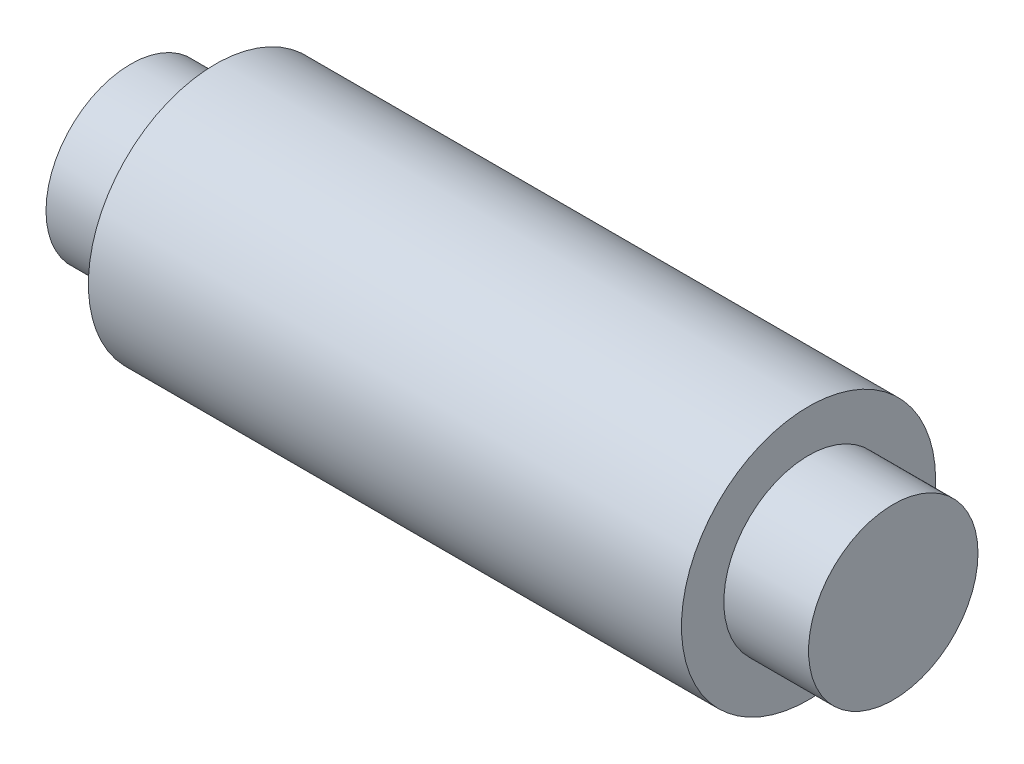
ISO-10303-21;
HEADER;
FILE_DESCRIPTION(('STEP AP214'),'2;1');
FILE_NAME('part.step','',(''),(''),'','','');
FILE_SCHEMA(('AUTOMOTIVE_DESIGN { 1 0 10303 214 1 1 1 1 }'));
ENDSEC;
DATA;
#1=APPLICATION_CONTEXT('core data for automotive mechanical design processes');
#2=APPLICATION_PROTOCOL_DEFINITION('international standard','automotive_design',2000,#1);
#3=PRODUCT_CONTEXT('',#1,'mechanical');
#4=PRODUCT('Part','Part','',(#3));
#5=PRODUCT_RELATED_PRODUCT_CATEGORY('part','',(#4));
#6=PRODUCT_DEFINITION_FORMATION('','',#4);
#7=PRODUCT_DEFINITION_CONTEXT('part definition',#1,'design');
#8=PRODUCT_DEFINITION('design','',#6,#7);
#9=PRODUCT_DEFINITION_SHAPE('','',#8);
#10=(LENGTH_UNIT() NAMED_UNIT(*) SI_UNIT(.MILLI.,.METRE.));
#11=(NAMED_UNIT(*) PLANE_ANGLE_UNIT() SI_UNIT($,.RADIAN.));
#12=(NAMED_UNIT(*) SI_UNIT($,.STERADIAN.) SOLID_ANGLE_UNIT());
#13=UNCERTAINTY_MEASURE_WITH_UNIT(LENGTH_MEASURE(1.E-05),#10,'distance_accuracy_value','');
#14=(GEOMETRIC_REPRESENTATION_CONTEXT(3) GLOBAL_UNCERTAINTY_ASSIGNED_CONTEXT((#13)) GLOBAL_UNIT_ASSIGNED_CONTEXT((#10,
#11,#12)) REPRESENTATION_CONTEXT('',''));
#15=CARTESIAN_POINT('',(0.,0.,0.));
#16=DIRECTION('',(0.,0.,1.));
#17=DIRECTION('',(1.,0.,0.));
#18=AXIS2_PLACEMENT_3D('',#15,#16,#17);
#19=CARTESIAN_POINT('',(35.,0.,0.));
#20=DIRECTION('',(-1.,0.,0.));
#21=DIRECTION('',(0.,0.,1.));
#22=AXIS2_PLACEMENT_3D('',#19,#20,#21);
#23=CYLINDRICAL_SURFACE('',#22,15.);
#24=CARTESIAN_POINT('',(35.,0.,0.));
#25=DIRECTION('',(1.,0.,0.));
#26=DIRECTION('',(0.,0.,-1.));
#27=AXIS2_PLACEMENT_3D('',#24,#25,#26);
#28=CIRCLE('',#27,15.);
#29=CARTESIAN_POINT('',(35.,0.,-15.));
#30=VERTEX_POINT('',#29);
#31=EDGE_CURVE('E37',#30,#30,#28,.T.);
#32=ORIENTED_EDGE('',*,*,#31,.F.);
#33=EDGE_LOOP('',(#32));
#34=FACE_BOUND('',#33,.T.);
#35=CARTESIAN_POINT('',(-35.,0.,0.));
#36=DIRECTION('',(1.,0.,0.));
#37=DIRECTION('',(0.,0.,-1.));
#38=AXIS2_PLACEMENT_3D('',#35,#36,#37);
#39=CIRCLE('',#38,15.);
#40=CARTESIAN_POINT('',(-35.,0.,-15.));
#41=VERTEX_POINT('',#40);
#42=EDGE_CURVE('E41',#41,#41,#39,.T.);
#43=ORIENTED_EDGE('',*,*,#42,.T.);
#44=EDGE_LOOP('',(#43));
#45=FACE_BOUND('',#44,.T.);
#46=ADVANCED_FACE('F31',(#34,#45),#23,.T.);
#47=CARTESIAN_POINT('',(35.,0.,0.));
#48=DIRECTION('',(1.,0.,0.));
#49=DIRECTION('',(0.,0.,-1.));
#50=AXIS2_PLACEMENT_3D('',#47,#48,#49);
#51=PLANE('',#50);
#52=CARTESIAN_POINT('',(35.,0.,0.));
#53=DIRECTION('',(1.,0.,0.));
#54=DIRECTION('',(0.,0.,-1.));
#55=AXIS2_PLACEMENT_3D('',#52,#53,#54);
#56=CIRCLE('',#55,10.);
#57=CARTESIAN_POINT('',(35.,0.,-10.));
#58=VERTEX_POINT('',#57);
#59=EDGE_CURVE('E48',#58,#58,#56,.T.);
#60=ORIENTED_EDGE('',*,*,#59,.F.);
#61=EDGE_LOOP('',(#60));
#62=FACE_BOUND('',#61,.T.);
#63=ORIENTED_EDGE('',*,*,#31,.T.);
#64=EDGE_LOOP('',(#63));
#65=FACE_BOUND('',#64,.T.);
#66=ADVANCED_FACE('F72',(#62,#65),#51,.T.);
#67=CARTESIAN_POINT('',(-35.,0.,0.));
#68=DIRECTION('',(1.,0.,0.));
#69=DIRECTION('',(0.,0.,-1.));
#70=AXIS2_PLACEMENT_3D('',#67,#68,#69);
#71=PLANE('',#70);
#72=CARTESIAN_POINT('',(-35.,0.,0.));
#73=DIRECTION('',(1.,0.,0.));
#74=DIRECTION('',(0.,0.,-1.));
#75=AXIS2_PLACEMENT_3D('',#72,#73,#74);
#76=CIRCLE('',#75,10.);
#77=CARTESIAN_POINT('',(-35.,0.,-10.));
#78=VERTEX_POINT('',#77);
#79=EDGE_CURVE('E10',#78,#78,#76,.F.);
#80=ORIENTED_EDGE('',*,*,#79,.F.);
#81=EDGE_LOOP('',(#80));
#82=FACE_BOUND('',#81,.T.);
#83=ORIENTED_EDGE('',*,*,#42,.F.);
#84=EDGE_LOOP('',(#83));
#85=FACE_BOUND('',#84,.T.);
#86=ADVANCED_FACE('F77',(#82,#85),#71,.F.);
#87=CARTESIAN_POINT('',(45.,0.,0.));
#88=DIRECTION('',(-1.,0.,0.));
#89=DIRECTION('',(0.,0.,1.));
#90=AXIS2_PLACEMENT_3D('',#87,#88,#89);
#91=CYLINDRICAL_SURFACE('',#90,10.);
#92=CARTESIAN_POINT('',(45.,0.,0.));
#93=DIRECTION('',(1.,0.,0.));
#94=DIRECTION('',(0.,0.,-1.));
#95=AXIS2_PLACEMENT_3D('',#92,#93,#94);
#96=CIRCLE('',#95,10.);
#97=CARTESIAN_POINT('',(45.,0.,-10.));
#98=VERTEX_POINT('',#97);
#99=EDGE_CURVE('E46',#98,#98,#96,.T.);
#100=ORIENTED_EDGE('',*,*,#99,.F.);
#101=EDGE_LOOP('',(#100));
#102=FACE_BOUND('',#101,.T.);
#103=ORIENTED_EDGE('',*,*,#59,.T.);
#104=EDGE_LOOP('',(#103));
#105=FACE_BOUND('',#104,.T.);
#106=ADVANCED_FACE('F68',(#102,#105),#91,.T.);
#107=CARTESIAN_POINT('',(45.,0.,0.));
#108=DIRECTION('',(1.,0.,0.));
#109=DIRECTION('',(0.,0.,-1.));
#110=AXIS2_PLACEMENT_3D('',#107,#108,#109);
#111=PLANE('',#110);
#112=ORIENTED_EDGE('',*,*,#99,.T.);
#113=EDGE_LOOP('',(#112));
#114=FACE_BOUND('',#113,.T.);
#115=ADVANCED_FACE('F61',(#114),#111,.T.);
#116=CARTESIAN_POINT('',(-45.,0.,0.));
#117=DIRECTION('',(1.,0.,0.));
#118=DIRECTION('',(0.,0.,-1.));
#119=AXIS2_PLACEMENT_3D('',#116,#117,#118);
#120=CYLINDRICAL_SURFACE('',#119,10.);
#121=CARTESIAN_POINT('',(-45.,0.,0.));
#122=DIRECTION('',(-1.,0.,0.));
#123=DIRECTION('',(0.,0.,1.));
#124=AXIS2_PLACEMENT_3D('',#121,#122,#123);
#125=CIRCLE('',#124,10.);
#126=CARTESIAN_POINT('',(-45.,0.,10.));
#127=VERTEX_POINT('',#126);
#128=EDGE_CURVE('E51',#127,#127,#125,.T.);
#129=ORIENTED_EDGE('',*,*,#128,.F.);
#130=EDGE_LOOP('',(#129));
#131=FACE_BOUND('',#130,.T.);
#132=ORIENTED_EDGE('',*,*,#79,.T.);
#133=EDGE_LOOP('',(#132));
#134=FACE_BOUND('',#133,.T.);
#135=ADVANCED_FACE('F59',(#131,#134),#120,.T.);
#136=CARTESIAN_POINT('',(-45.,0.,0.));
#137=DIRECTION('',(-1.,0.,0.));
#138=DIRECTION('',(0.,0.,1.));
#139=AXIS2_PLACEMENT_3D('',#136,#137,#138);
#140=PLANE('',#139);
#141=ORIENTED_EDGE('',*,*,#128,.T.);
#142=EDGE_LOOP('',(#141));
#143=FACE_BOUND('',#142,.T.);
#144=ADVANCED_FACE('F57',(#143),#140,.T.);
#145=CLOSED_SHELL('',(#46,#66,#86,#106,#115,#135,#144));
#146=MANIFOLD_SOLID_BREP('B2',#145);
#147=ADVANCED_BREP_SHAPE_REPRESENTATION('',(#18,#146),#14);
#148=SHAPE_DEFINITION_REPRESENTATION(#9,#147);
ENDSEC;
END-ISO-10303-21;
